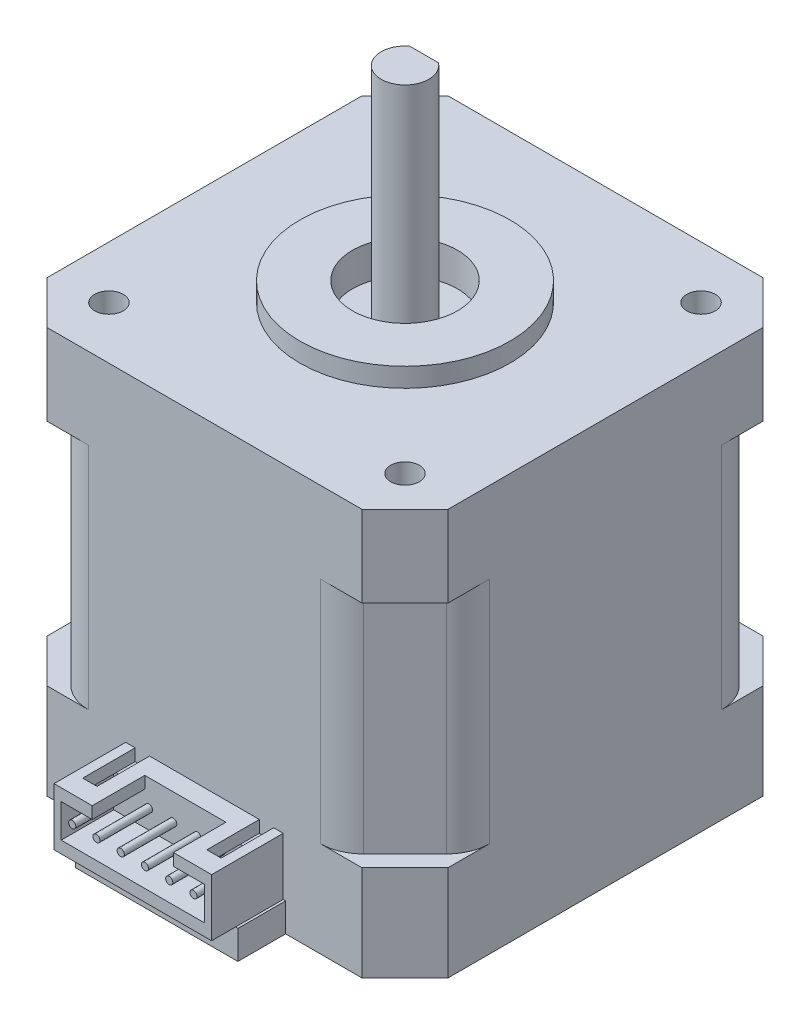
from build123d import *

# Parameters (mm, degrees)
BOSS_EXTRUDE1_DEPTH  = 10
BOSS_EXTRUDE3_DEPTH  = 24
BOSS_EXTRUDE4_DEPTH  = 8.5
SKETCH5_R            = 11
BOSS_EXTRUDE5_DEPTH  = 2
CUT_EXTRUDE1_REACH   = 53.848
SKETCH6_R            = 1.5
SKETCH7_R            = 5.5
CUT_EXTRUDE2_DEPTH   = 3.5
SKETCH8_R            = 2.5
BOSS_EXTRUDE6_DEPTH  = 3.5
BOSS_EXTRUDE7_DEPTH  = 19.5
SKETCH10_R           = 3.5
CUT_EXTRUDE3_DEPTH   = 3
SKETCH11_W           = 17
SKETCH11_H           = 3
BOSS_EXTRUDE8_DEPTH  = 5
SKETCH12_W           = 16.5
SKETCH12_H           = 6
BOSS_EXTRUDE9_DEPTH  = 7.5
SKETCH13_W           = 15
SKETCH13_H           = 3.5
CUT_EXTRUDE4_DEPTH   = 5.5
CUT_EXTRUDE5_REACH   = 67.408
SKETCH14_W           = 8.5
SKETCH14_H           = 5.5
SKETCH15_W           = 1.5
SKETCH15_H           = 5.5
CUT_EXTRUDE6_DEPTH   = 1.25
SKETCH16_R           = 0.375
BOSS_EXTRUDE10_DEPTH = 5.5


with BuildPart() as part:
    # Sketch1 → Boss-Extrude1 (new body)
    with BuildSketch(Plane(origin=(0, 0, 0), x_dir=(1, 0, 0), z_dir=(0, 1, 0))):
        Polygon((-21, 16.5), (-16.5, 21), (16.5, 21), (21, 16.5), (21, -16.5), (16.5, -21), (-16.5, -21), (-21, -16.5), align=None)
    extrude(amount=BOSS_EXTRUDE1_DEPTH)

    # Sketch2 → Boss-Extrude3 (add)
    with BuildSketch(Plane(origin=(0, 10, 0), x_dir=(1, 0, 0), z_dir=(0, 1, 0))):
        with BuildLine():
            Line((-15.318019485, 19.681980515), (-19.681980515, 15.318019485))
            ThreePointArc((-19.681980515, 15.318019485), (-20.657457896, 13.858114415), (-21, 12.136038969))
            Line((-21, 12.136038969), (-21, -12.136038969))
            ThreePointArc((-21, -12.136038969), (-20.657457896, -13.858114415), (-19.681980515, -15.318019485))
            Line((-19.681980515, -15.318019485), (-15.318019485, -19.681980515))
            ThreePointArc((-15.318019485, -19.681980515), (-13.858114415, -20.657457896), (-12.136038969, -21))
            Line((-12.136038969, -21), (12.136038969, -21))
            ThreePointArc((12.136038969, -21), (13.858114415, -20.657457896), (15.318019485, -19.681980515))
            Line((15.318019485, -19.681980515), (19.681980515, -15.318019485))
            ThreePointArc((19.681980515, -15.318019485), (20.657457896, -13.858114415), (21, -12.136038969))
            Line((21, -12.136038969), (21, 12.136038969))
            ThreePointArc((21, 12.136038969), (20.657457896, 13.858114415), (19.681980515, 15.318019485))
            Line((19.681980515, 15.318019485), (15.318019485, 19.681980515))
            ThreePointArc((15.318019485, 19.681980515), (13.858114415, 20.657457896), (12.136038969, 21))
            Line((12.136038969, 21), (-12.136038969, 21))
            ThreePointArc((-12.136038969, 21), (-13.858114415, 20.657457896), (-15.318019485, 19.681980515))
        make_face()
    extrude(amount=BOSS_EXTRUDE3_DEPTH)

    # Sketch4 → Boss-Extrude4 (add)
    with BuildSketch(Plane(origin=(0, 34, 0), x_dir=(1, 0, 0), z_dir=(0, 1, 0))):
        Polygon((-16.5, 21), (-21, 16.5), (-21, -16.5), (-16.5, -21), (16.5, -21), (21, -16.5), (21, 16.5), (16.5, 21), align=None)
    extrude(amount=BOSS_EXTRUDE4_DEPTH)

    # Sketch5 → Boss-Extrude5 (add)
    with BuildSketch(Plane(origin=(0, 42.5, 0), x_dir=(1, 0, 0), z_dir=(0, 1, 0))):
        with Locations(Location((0, 0, 0), (0, 0, 270))):
            Circle(SKETCH5_R)
    extrude(amount=BOSS_EXTRUDE5_DEPTH)

    # Sketch6 → Cut-Extrude1 (cut, up to next)
    with BuildSketch(Plane(origin=(0, 42.5, 0), x_dir=(1, 0, 0), z_dir=(0, 1, 0)), mode=Mode.PRIVATE) as cut_extrude1_sk1:
        with Locations(Location((-15.5, 15.5, 0), (0, 0, 270))):
            Circle(SKETCH6_R)
    cut_extrude1_tool1 = extrude(cut_extrude1_sk1.sketch, amount=-CUT_EXTRUDE1_REACH, mode=Mode.PRIVATE) & part.part
    # Sketch6 → Cut-Extrude1 (cut, up to next)
    with BuildSketch(Plane(origin=(0, 42.5, 0), x_dir=(1, 0, 0), z_dir=(0, 1, 0)), mode=Mode.PRIVATE) as cut_extrude1_sk2:
        with Locations(Location((15.5, 15.5, 0), (0, 0, 270))):
            Circle(SKETCH6_R)
    cut_extrude1_tool2 = extrude(cut_extrude1_sk2.sketch, amount=-CUT_EXTRUDE1_REACH, mode=Mode.PRIVATE) & part.part
    # Sketch6 → Cut-Extrude1 (cut, up to next)
    with BuildSketch(Plane(origin=(0, 42.5, 0), x_dir=(1, 0, 0), z_dir=(0, 1, 0)), mode=Mode.PRIVATE) as cut_extrude1_sk3:
        with Locations(Location((15.5, -15.5, 0), (0, 0, 270))):
            Circle(SKETCH6_R)
    cut_extrude1_tool3 = extrude(cut_extrude1_sk3.sketch, amount=-CUT_EXTRUDE1_REACH, mode=Mode.PRIVATE) & part.part
    # Sketch6 → Cut-Extrude1 (cut, up to next)
    with BuildSketch(Plane(origin=(0, 42.5, 0), x_dir=(1, 0, 0), z_dir=(0, 1, 0)), mode=Mode.PRIVATE) as cut_extrude1_sk4:
        with Locations(Location((-15.5, -15.5, 0), (0, 0, 270))):
            Circle(SKETCH6_R)
    cut_extrude1_tool4 = extrude(cut_extrude1_sk4.sketch, amount=-CUT_EXTRUDE1_REACH, mode=Mode.PRIVATE) & part.part
    add(cut_extrude1_tool1.solids().sort_by_distance((-15.5, 42.5, -15.5))[0], mode=Mode.SUBTRACT)
    add(cut_extrude1_tool2.solids().sort_by_distance((15.5, 42.5, -15.5))[0], mode=Mode.SUBTRACT)
    add(cut_extrude1_tool3.solids().sort_by_distance((15.5, 42.5, 15.5))[0], mode=Mode.SUBTRACT)
    add(cut_extrude1_tool4.solids().sort_by_distance((-15.5, 42.5, 15.5))[0], mode=Mode.SUBTRACT)

    # Sketch7 → Cut-Extrude2 (cut)
    with BuildSketch(Plane(origin=(0, 44.5, 0), x_dir=(1, 0, 0), z_dir=(0, 1, 0))):
        with Locations(Location((0, 0, 0), (0, 0, 270))):
            Circle(SKETCH7_R)
    extrude(amount=-CUT_EXTRUDE2_DEPTH, mode=Mode.SUBTRACT)

    # Sketch8 → Boss-Extrude6 (add)
    with BuildSketch(Plane(origin=(0, 41, 0), x_dir=(1, 0, 0), z_dir=(0, 1, 0))):
        with Locations(Location((0, 0, 0), (0, 0, 270))):
            Circle(SKETCH8_R)
    extrude(amount=BOSS_EXTRUDE6_DEPTH)

    # Sketch9 → Boss-Extrude7 (add)
    with BuildSketch(Plane(origin=(0, 44.5, 0), x_dir=(1, 0, 0), z_dir=(0, 1, 0))):
        with BuildLine():
            Line((-1.5, 2), (1.5, 2))
            ThreePointArc((1.5, 2), (0, -2.5), (-1.5, 2))
        make_face()
    extrude(amount=BOSS_EXTRUDE7_DEPTH)

    # Sketch10 → Cut-Extrude3 (cut)
    with BuildSketch(Plane.XZ):
        with Locations(Location((-15.5, 15.5, 0), (0, 0, 270))):
            Circle(SKETCH10_R)
        with Locations(Location((15.5, 15.5, 0), (0, 0, 270))):
            Circle(SKETCH10_R)
        with Locations(Location((15.5, -15.5, 0), (0, 0, 270))):
            Circle(SKETCH10_R)
        with Locations(Location((-15.5, -15.5, 0), (0, 0, 270))):
            Circle(SKETCH10_R)
    extrude(amount=-CUT_EXTRUDE3_DEPTH, mode=Mode.SUBTRACT)

    # Sketch11 → Boss-Extrude8 (add)
    with BuildSketch(Plane.XY.offset(21)):
        with Locations((0, 1.5)):
            Rectangle(SKETCH11_W, SKETCH11_H)
    extrude(amount=BOSS_EXTRUDE8_DEPTH)

    # Sketch12 → Boss-Extrude9 (add)
    with BuildSketch(Plane.XY.offset(21)):
        with Locations((0, 6)):
            Rectangle(SKETCH12_W, SKETCH12_H)
    extrude(amount=BOSS_EXTRUDE9_DEPTH)

    # Sketch13 → Cut-Extrude4 (cut)
    with BuildSketch(Plane.XY.offset(28.5)):
        with Locations((0, 6)):
            Rectangle(SKETCH13_W, SKETCH13_H)
    extrude(amount=-CUT_EXTRUDE4_DEPTH, mode=Mode.SUBTRACT)

    # Sketch14 → Cut-Extrude5 (cut, up to next)
    with BuildSketch(Plane(origin=(0, 9, 0), x_dir=(1, 0, 0), z_dir=(0, 1, 0)), mode=Mode.PRIVATE) as cut_extrude5_sk1:
        with Locations((0, -25.75)):
            Rectangle(SKETCH14_W, SKETCH14_H)
    cut_extrude5_tool1 = extrude(cut_extrude5_sk1.sketch, amount=-CUT_EXTRUDE5_REACH, mode=Mode.PRIVATE) & part.part
    add(cut_extrude5_tool1.solids().sort_by_distance((0, 9, 25.75))[0], mode=Mode.SUBTRACT)

    # Sketch15 → Cut-Extrude6 (cut)
    with BuildSketch(Plane(origin=(0, 9, 0), x_dir=(1, 0, 0), z_dir=(0, 1, 0))):
        with Locations((-6.5, -23.75)):
            Rectangle(SKETCH15_W, SKETCH15_H)
        with Locations((6.5, -23.75)):
            Rectangle(SKETCH15_W, SKETCH15_H)
    extrude(amount=-CUT_EXTRUDE6_DEPTH, mode=Mode.SUBTRACT)

    # Sketch16 → Boss-Extrude10 (add)
    with BuildSketch(Plane.XY.offset(23)):
        with Locations(Location((-1.27, 6.25, 0), (0, 0, 180))):
            Circle(SKETCH16_R)
        with Locations(Location((1.27, 6.25, 0), (0, 0, 180))):
            Circle(SKETCH16_R)
        with Locations(Location((-3.81, 6.25, 0), (0, 0, 180))):
            Circle(SKETCH16_R)
        with Locations(Location((-6.35, 6.25, 0), (0, 0, 180))):
            Circle(SKETCH16_R)
        with Locations(Location((3.81, 6.25, 0), (0, 0, 180))):
            Circle(SKETCH16_R)
        with Locations(Location((6.35, 6.25, 0), (0, 0, 180))):
            Circle(SKETCH16_R)
    extrude(amount=BOSS_EXTRUDE10_DEPTH)


solid = part.part
